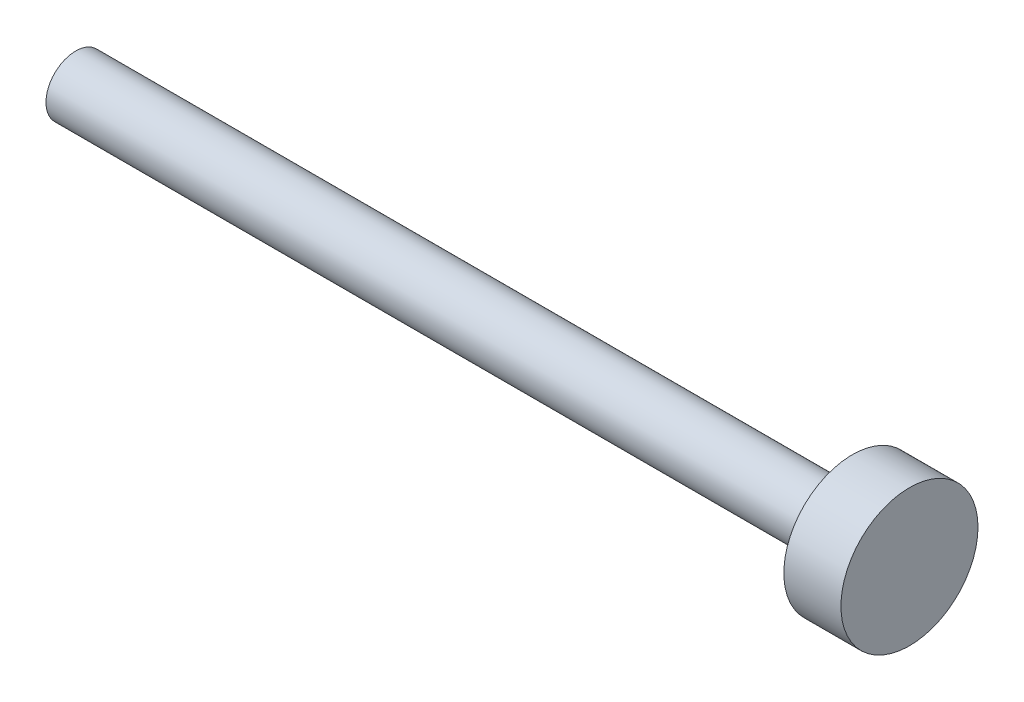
from build123d import *

# Parameters (mm, degrees)
SKETCH1_R           = 1.651
BOSS_EXTRUDE1_DEPTH = 43.18
SKETCH2_R           = 3.81
BOSS_EXTRUDE2_DEPTH = 3.175


with BuildPart() as part:
    # Sketch1 → Boss-Extrude1 (new body)
    with BuildSketch(Plane(origin=(0, 0, 0), x_dir=(0, 0, -1), z_dir=(1, 0, 0))):
        Circle(SKETCH1_R)
    extrude(amount=BOSS_EXTRUDE1_DEPTH)

    # Sketch2 → Boss-Extrude2 (add)
    with BuildSketch(Plane(origin=(43.18, 0, 0), x_dir=(0, 0, -1), z_dir=(1, 0, 0))):
        Circle(SKETCH2_R)
    extrude(amount=BOSS_EXTRUDE2_DEPTH)


solid = part.part
